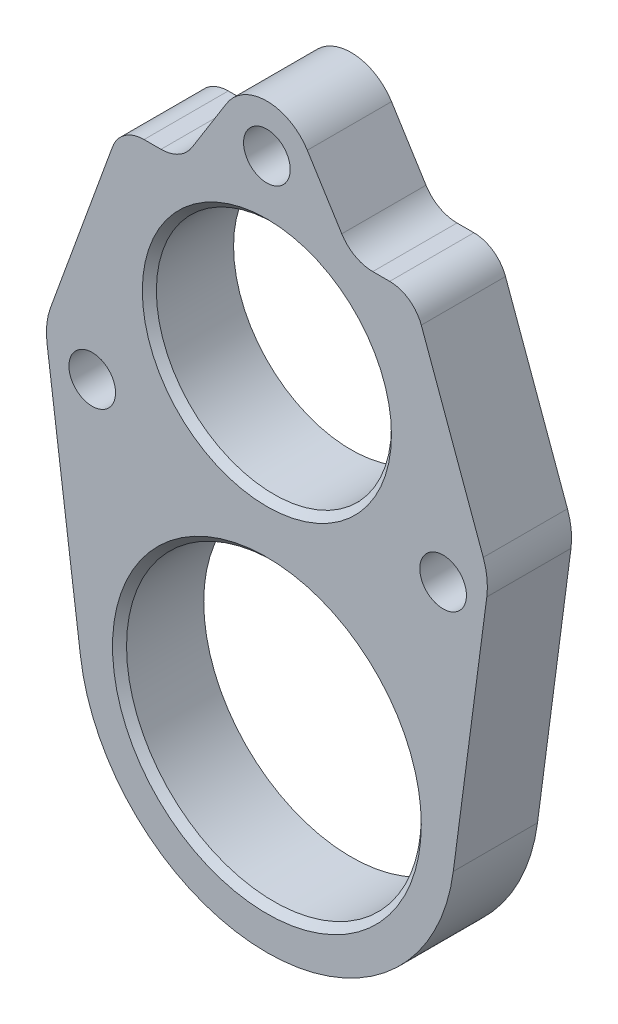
ISO-10303-21;
HEADER;
FILE_DESCRIPTION(('STEP AP214'),'2;1');
FILE_NAME('part.step','',(''),(''),'','','');
FILE_SCHEMA(('AUTOMOTIVE_DESIGN { 1 0 10303 214 1 1 1 1 }'));
ENDSEC;
DATA;
#1=APPLICATION_CONTEXT('core data for automotive mechanical design processes');
#2=APPLICATION_PROTOCOL_DEFINITION('international standard','automotive_design',2000,#1);
#3=PRODUCT_CONTEXT('',#1,'mechanical');
#4=PRODUCT('Part','Part','',(#3));
#5=PRODUCT_RELATED_PRODUCT_CATEGORY('part','',(#4));
#6=PRODUCT_DEFINITION_FORMATION('','',#4);
#7=PRODUCT_DEFINITION_CONTEXT('part definition',#1,'design');
#8=PRODUCT_DEFINITION('design','',#6,#7);
#9=PRODUCT_DEFINITION_SHAPE('','',#8);
#10=(LENGTH_UNIT() NAMED_UNIT(*) SI_UNIT(.MILLI.,.METRE.));
#11=(NAMED_UNIT(*) PLANE_ANGLE_UNIT() SI_UNIT($,.RADIAN.));
#12=(NAMED_UNIT(*) SI_UNIT($,.STERADIAN.) SOLID_ANGLE_UNIT());
#13=UNCERTAINTY_MEASURE_WITH_UNIT(LENGTH_MEASURE(1.E-05),#10,'distance_accuracy_value','');
#14=(GEOMETRIC_REPRESENTATION_CONTEXT(3) GLOBAL_UNCERTAINTY_ASSIGNED_CONTEXT((#13)) GLOBAL_UNIT_ASSIGNED_CONTEXT((#10,
#11,#12)) REPRESENTATION_CONTEXT('',''));
#15=CARTESIAN_POINT('',(0.,0.,0.));
#16=DIRECTION('',(0.,0.,1.));
#17=DIRECTION('',(1.,0.,0.));
#18=AXIS2_PLACEMENT_3D('',#15,#16,#17);
#19=CARTESIAN_POINT('',(-17.5,14.,12.));
#20=DIRECTION('',(0.,0.,-1.));
#21=DIRECTION('',(-1.,0.,0.));
#22=AXIS2_PLACEMENT_3D('',#19,#20,#21);
#23=CYLINDRICAL_SURFACE('',#22,4.79053922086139);
#24=CARTESIAN_POINT('',(-17.5,14.,0.));
#25=DIRECTION('',(0.,0.,1.));
#26=DIRECTION('',(1.,0.,0.));
#27=AXIS2_PLACEMENT_3D('',#24,#25,#26);
#28=CIRCLE('',#27,4.79053922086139);
#29=CARTESIAN_POINT('',(-17.5,18.7905392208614,0.));
#30=VERTEX_POINT('',#29);
#31=CARTESIAN_POINT('',(-22.0016343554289,15.6384609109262,0.));
#32=VERTEX_POINT('',#31);
#33=EDGE_CURVE('E149',#30,#32,#28,.T.);
#34=ORIENTED_EDGE('',*,*,#33,.T.);
#35=DIRECTION('',(0.,0.,-1.));
#36=VECTOR('',#35,1.);
#37=CARTESIAN_POINT('',(-22.0016343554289,15.6384609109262,12.));
#38=LINE('',#37,#36);
#39=CARTESIAN_POINT('',(-22.0016343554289,15.6384609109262,12.));
#40=VERTEX_POINT('',#39);
#41=EDGE_CURVE('E157',#40,#32,#38,.T.);
#42=ORIENTED_EDGE('',*,*,#41,.F.);
#43=CARTESIAN_POINT('',(-17.5,14.,12.));
#44=DIRECTION('',(0.,0.,1.));
#45=DIRECTION('',(1.,0.,0.));
#46=AXIS2_PLACEMENT_3D('',#43,#44,#45);
#47=CIRCLE('',#46,4.79053922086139);
#48=CARTESIAN_POINT('',(-17.5,18.7905392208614,12.));
#49=VERTEX_POINT('',#48);
#50=EDGE_CURVE('E201',#49,#40,#47,.T.);
#51=ORIENTED_EDGE('',*,*,#50,.F.);
#52=DIRECTION('',(0.,0.,-1.));
#53=VECTOR('',#52,1.);
#54=CARTESIAN_POINT('',(-17.5,18.7905392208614,12.));
#55=LINE('',#54,#53);
#56=EDGE_CURVE('E166',#49,#30,#55,.T.);
#57=ORIENTED_EDGE('',*,*,#56,.T.);
#58=EDGE_LOOP('',(#34,#42,#51,#57));
#59=FACE_BOUND('',#58,.T.);
#60=ADVANCED_FACE('F32',(#59),#23,.T.);
#61=CARTESIAN_POINT('',(-22.0016343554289,15.6384609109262,12.));
#62=DIRECTION('',(0.939692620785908,-0.342020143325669,0.));
#63=DIRECTION('',(0.34202014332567,0.939692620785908,0.));
#64=AXIS2_PLACEMENT_3D('',#61,#62,#63);
#65=PLANE('',#64);
#66=DIRECTION('',(-0.34202014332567,-0.939692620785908,0.));
#67=VECTOR('',#66,1.);
#68=CARTESIAN_POINT('',(-22.0016343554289,15.6384609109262,0.));
#69=LINE('',#68,#67);
#70=CARTESIAN_POINT('',(-30.8281438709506,-8.61217467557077,0.));
#71=VERTEX_POINT('',#70);
#72=EDGE_CURVE('E144',#32,#71,#69,.T.);
#73=ORIENTED_EDGE('',*,*,#72,.T.);
#74=DIRECTION('',(0.,0.,-1.));
#75=VECTOR('',#74,1.);
#76=CARTESIAN_POINT('',(-30.8281438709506,-8.61217467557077,12.));
#77=LINE('',#76,#75);
#78=CARTESIAN_POINT('',(-30.8281438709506,-8.61217467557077,12.));
#79=VERTEX_POINT('',#78);
#80=EDGE_CURVE('E163',#79,#71,#77,.T.);
#81=ORIENTED_EDGE('',*,*,#80,.F.);
#82=DIRECTION('',(-0.34202014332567,-0.939692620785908,0.));
#83=VECTOR('',#82,1.);
#84=CARTESIAN_POINT('',(-22.0016343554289,15.6384609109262,12.));
#85=LINE('',#84,#83);
#86=EDGE_CURVE('E159',#40,#79,#85,.T.);
#87=ORIENTED_EDGE('',*,*,#86,.F.);
#88=ORIENTED_EDGE('',*,*,#41,.T.);
#89=EDGE_LOOP('',(#73,#81,#87,#88));
#90=FACE_BOUND('',#89,.T.);
#91=ADVANCED_FACE('F158',(#90),#65,.F.);
#92=CARTESIAN_POINT('',(-21.6280464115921,-11.9607363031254,12.));
#93=DIRECTION('',(0.,0.,-1.));
#94=DIRECTION('',(-1.,0.,0.));
#95=AXIS2_PLACEMENT_3D('',#92,#93,#94);
#96=CYLINDRICAL_SURFACE('',#95,9.79053922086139);
#97=CARTESIAN_POINT('',(-21.6280464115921,-11.9607363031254,0.));
#98=DIRECTION('',(0.,0.,1.));
#99=DIRECTION('',(1.,0.,0.));
#100=AXIS2_PLACEMENT_3D('',#97,#98,#99);
#101=CIRCLE('',#100,9.79053922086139);
#102=CARTESIAN_POINT('',(-31.3348262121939,-13.2386581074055,0.));
#103=VERTEX_POINT('',#102);
#104=EDGE_CURVE('E151',#71,#103,#101,.T.);
#105=ORIENTED_EDGE('',*,*,#104,.T.);
#106=DIRECTION('',(0.,0.,-1.));
#107=VECTOR('',#106,1.);
#108=CARTESIAN_POINT('',(-31.3348262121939,-13.2386581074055,12.));
#109=LINE('',#108,#107);
#110=CARTESIAN_POINT('',(-31.3348262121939,-13.2386581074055,12.));
#111=VERTEX_POINT('',#110);
#112=EDGE_CURVE('E267',#111,#103,#109,.T.);
#113=ORIENTED_EDGE('',*,*,#112,.F.);
#114=CARTESIAN_POINT('',(-21.6280464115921,-11.9607363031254,12.));
#115=DIRECTION('',(0.,0.,1.));
#116=DIRECTION('',(1.,0.,0.));
#117=AXIS2_PLACEMENT_3D('',#114,#115,#116);
#118=CIRCLE('',#117,9.79053922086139);
#119=EDGE_CURVE('E204',#79,#111,#118,.T.);
#120=ORIENTED_EDGE('',*,*,#119,.F.);
#121=ORIENTED_EDGE('',*,*,#80,.T.);
#122=EDGE_LOOP('',(#105,#113,#120,#121));
#123=FACE_BOUND('',#122,.T.);
#124=ADVANCED_FACE('F307',(#123),#96,.T.);
#125=CARTESIAN_POINT('',(-31.3348262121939,-13.2386581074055,12.));
#126=DIRECTION('',(0.991444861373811,0.130526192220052,0.));
#127=DIRECTION('',(-0.130526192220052,0.991444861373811,0.));
#128=AXIS2_PLACEMENT_3D('',#125,#126,#127);
#129=PLANE('',#128);
#130=DIRECTION('',(0.130526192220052,-0.991444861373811,0.));
#131=VECTOR('',#130,1.);
#132=CARTESIAN_POINT('',(-31.3348262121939,-13.2386581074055,0.));
#133=LINE('',#132,#131);
#134=CARTESIAN_POINT('',(-26.5613424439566,-49.496867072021,0.));
#135=VERTEX_POINT('',#134);
#136=EDGE_CURVE('E175',#103,#135,#133,.T.);
#137=ORIENTED_EDGE('',*,*,#136,.T.);
#138=DIRECTION('',(0.,0.,-1.));
#139=VECTOR('',#138,1.);
#140=CARTESIAN_POINT('',(-26.5613424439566,-49.496867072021,12.));
#141=LINE('',#140,#139);
#142=CARTESIAN_POINT('',(-26.5613424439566,-49.496867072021,12.));
#143=VERTEX_POINT('',#142);
#144=EDGE_CURVE('E264',#143,#135,#141,.T.);
#145=ORIENTED_EDGE('',*,*,#144,.F.);
#146=DIRECTION('',(0.130526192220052,-0.991444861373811,0.));
#147=VECTOR('',#146,1.);
#148=CARTESIAN_POINT('',(-31.3348262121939,-13.2386581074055,12.));
#149=LINE('',#148,#147);
#150=EDGE_CURVE('E206',#111,#143,#149,.T.);
#151=ORIENTED_EDGE('',*,*,#150,.F.);
#152=ORIENTED_EDGE('',*,*,#112,.T.);
#153=EDGE_LOOP('',(#137,#145,#151,#152));
#154=FACE_BOUND('',#153,.T.);
#155=ADVANCED_FACE('F311',(#154),#129,.F.);
#156=CARTESIAN_POINT('',(0.,-46.,12.));
#157=DIRECTION('',(0.,0.,-1.));
#158=DIRECTION('',(-1.,0.,0.));
#159=AXIS2_PLACEMENT_3D('',#156,#157,#158);
#160=CYLINDRICAL_SURFACE('',#159,26.7905392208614);
#161=CARTESIAN_POINT('',(0.,-46.,0.));
#162=DIRECTION('',(0.,0.,1.));
#163=DIRECTION('',(1.,0.,0.));
#164=AXIS2_PLACEMENT_3D('',#161,#162,#163);
#165=CIRCLE('',#164,26.7905392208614);
#166=CARTESIAN_POINT('',(26.5613424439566,-49.496867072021,0.));
#167=VERTEX_POINT('',#166);
#168=EDGE_CURVE('E177',#135,#167,#165,.T.);
#169=ORIENTED_EDGE('',*,*,#168,.T.);
#170=DIRECTION('',(0.,0.,-1.));
#171=VECTOR('',#170,1.);
#172=CARTESIAN_POINT('',(26.5613424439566,-49.496867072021,12.));
#173=LINE('',#172,#171);
#174=CARTESIAN_POINT('',(26.5613424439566,-49.496867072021,12.));
#175=VERTEX_POINT('',#174);
#176=EDGE_CURVE('E261',#175,#167,#173,.T.);
#177=ORIENTED_EDGE('',*,*,#176,.F.);
#178=CARTESIAN_POINT('',(0.,-46.,12.));
#179=DIRECTION('',(0.,0.,1.));
#180=DIRECTION('',(1.,0.,0.));
#181=AXIS2_PLACEMENT_3D('',#178,#179,#180);
#182=CIRCLE('',#181,26.7905392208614);
#183=EDGE_CURVE('E208',#143,#175,#182,.T.);
#184=ORIENTED_EDGE('',*,*,#183,.F.);
#185=ORIENTED_EDGE('',*,*,#144,.T.);
#186=EDGE_LOOP('',(#169,#177,#184,#185));
#187=FACE_BOUND('',#186,.T.);
#188=ADVANCED_FACE('F317',(#187),#160,.T.);
#189=CARTESIAN_POINT('',(26.5613424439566,-49.496867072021,12.));
#190=DIRECTION('',(-0.991444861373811,0.130526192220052,0.));
#191=DIRECTION('',(-0.130526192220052,-0.991444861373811,0.));
#192=AXIS2_PLACEMENT_3D('',#189,#190,#191);
#193=PLANE('',#192);
#194=DIRECTION('',(0.130526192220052,0.991444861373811,0.));
#195=VECTOR('',#194,1.);
#196=CARTESIAN_POINT('',(26.5613424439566,-49.496867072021,0.));
#197=LINE('',#196,#195);
#198=CARTESIAN_POINT('',(31.3348262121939,-13.2386581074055,0.));
#199=VERTEX_POINT('',#198);
#200=EDGE_CURVE('E179',#167,#199,#197,.T.);
#201=ORIENTED_EDGE('',*,*,#200,.T.);
#202=DIRECTION('',(0.,0.,-1.));
#203=VECTOR('',#202,1.);
#204=CARTESIAN_POINT('',(31.3348262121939,-13.2386581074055,12.));
#205=LINE('',#204,#203);
#206=CARTESIAN_POINT('',(31.3348262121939,-13.2386581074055,12.));
#207=VERTEX_POINT('',#206);
#208=EDGE_CURVE('E258',#207,#199,#205,.T.);
#209=ORIENTED_EDGE('',*,*,#208,.F.);
#210=DIRECTION('',(0.130526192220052,0.991444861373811,0.));
#211=VECTOR('',#210,1.);
#212=CARTESIAN_POINT('',(26.5613424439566,-49.496867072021,12.));
#213=LINE('',#212,#211);
#214=EDGE_CURVE('E210',#175,#207,#213,.T.);
#215=ORIENTED_EDGE('',*,*,#214,.F.);
#216=ORIENTED_EDGE('',*,*,#176,.T.);
#217=EDGE_LOOP('',(#201,#209,#215,#216));
#218=FACE_BOUND('',#217,.T.);
#219=ADVANCED_FACE('F321',(#218),#193,.F.);
#220=CARTESIAN_POINT('',(21.6280464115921,-11.9607363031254,12.));
#221=DIRECTION('',(0.,0.,-1.));
#222=DIRECTION('',(-1.,0.,0.));
#223=AXIS2_PLACEMENT_3D('',#220,#221,#222);
#224=CYLINDRICAL_SURFACE('',#223,9.79053922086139);
#225=CARTESIAN_POINT('',(21.6280464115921,-11.9607363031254,0.));
#226=DIRECTION('',(0.,0.,1.));
#227=DIRECTION('',(1.,0.,0.));
#228=AXIS2_PLACEMENT_3D('',#225,#226,#227);
#229=CIRCLE('',#228,9.79053922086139);
#230=CARTESIAN_POINT('',(30.8281438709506,-8.61217467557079,0.));
#231=VERTEX_POINT('',#230);
#232=EDGE_CURVE('E181',#199,#231,#229,.T.);
#233=ORIENTED_EDGE('',*,*,#232,.T.);
#234=DIRECTION('',(0.,0.,-1.));
#235=VECTOR('',#234,1.);
#236=CARTESIAN_POINT('',(30.8281438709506,-8.61217467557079,12.));
#237=LINE('',#236,#235);
#238=CARTESIAN_POINT('',(30.8281438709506,-8.61217467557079,12.));
#239=VERTEX_POINT('',#238);
#240=EDGE_CURVE('E255',#239,#231,#237,.T.);
#241=ORIENTED_EDGE('',*,*,#240,.F.);
#242=CARTESIAN_POINT('',(21.6280464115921,-11.9607363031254,12.));
#243=DIRECTION('',(0.,0.,1.));
#244=DIRECTION('',(1.,0.,0.));
#245=AXIS2_PLACEMENT_3D('',#242,#243,#244);
#246=CIRCLE('',#245,9.79053922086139);
#247=EDGE_CURVE('E212',#207,#239,#246,.T.);
#248=ORIENTED_EDGE('',*,*,#247,.F.);
#249=ORIENTED_EDGE('',*,*,#208,.T.);
#250=EDGE_LOOP('',(#233,#241,#248,#249));
#251=FACE_BOUND('',#250,.T.);
#252=ADVANCED_FACE('F326',(#251),#224,.T.);
#253=CARTESIAN_POINT('',(30.8281438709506,-8.61217467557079,12.));
#254=DIRECTION('',(-0.939692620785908,-0.34202014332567,0.));
#255=DIRECTION('',(0.342020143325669,-0.939692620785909,0.));
#256=AXIS2_PLACEMENT_3D('',#253,#254,#255);
#257=PLANE('',#256);
#258=DIRECTION('',(-0.342020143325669,0.939692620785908,0.));
#259=VECTOR('',#258,1.);
#260=CARTESIAN_POINT('',(30.8281438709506,-8.61217467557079,0.));
#261=LINE('',#260,#259);
#262=CARTESIAN_POINT('',(22.0016343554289,15.6384609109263,0.));
#263=VERTEX_POINT('',#262);
#264=EDGE_CURVE('E183',#231,#263,#261,.T.);
#265=ORIENTED_EDGE('',*,*,#264,.T.);
#266=DIRECTION('',(0.,0.,-1.));
#267=VECTOR('',#266,1.);
#268=CARTESIAN_POINT('',(22.0016343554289,15.6384609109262,12.));
#269=LINE('',#268,#267);
#270=CARTESIAN_POINT('',(22.0016343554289,15.6384609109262,12.));
#271=VERTEX_POINT('',#270);
#272=EDGE_CURVE('E252',#271,#263,#269,.T.);
#273=ORIENTED_EDGE('',*,*,#272,.F.);
#274=DIRECTION('',(-0.342020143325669,0.939692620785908,0.));
#275=VECTOR('',#274,1.);
#276=CARTESIAN_POINT('',(30.8281438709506,-8.61217467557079,12.));
#277=LINE('',#276,#275);
#278=EDGE_CURVE('E214',#239,#271,#277,.T.);
#279=ORIENTED_EDGE('',*,*,#278,.F.);
#280=ORIENTED_EDGE('',*,*,#240,.T.);
#281=EDGE_LOOP('',(#265,#273,#279,#280));
#282=FACE_BOUND('',#281,.T.);
#283=ADVANCED_FACE('F332',(#282),#257,.F.);
#284=CARTESIAN_POINT('',(17.5,14.,12.));
#285=DIRECTION('',(0.,0.,-1.));
#286=DIRECTION('',(-1.,0.,0.));
#287=AXIS2_PLACEMENT_3D('',#284,#285,#286);
#288=CYLINDRICAL_SURFACE('',#287,4.79053922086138);
#289=CARTESIAN_POINT('',(17.5,14.,0.));
#290=DIRECTION('',(0.,0.,1.));
#291=DIRECTION('',(1.,0.,0.));
#292=AXIS2_PLACEMENT_3D('',#289,#290,#291);
#293=CIRCLE('',#292,4.79053922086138);
#294=CARTESIAN_POINT('',(17.5,18.7905392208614,0.));
#295=VERTEX_POINT('',#294);
#296=EDGE_CURVE('E185',#263,#295,#293,.T.);
#297=ORIENTED_EDGE('',*,*,#296,.T.);
#298=DIRECTION('',(0.,0.,-1.));
#299=VECTOR('',#298,1.);
#300=CARTESIAN_POINT('',(17.5,18.7905392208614,12.));
#301=LINE('',#300,#299);
#302=CARTESIAN_POINT('',(17.5,18.7905392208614,12.));
#303=VERTEX_POINT('',#302);
#304=EDGE_CURVE('E249',#303,#295,#301,.T.);
#305=ORIENTED_EDGE('',*,*,#304,.F.);
#306=CARTESIAN_POINT('',(17.5,14.,12.));
#307=DIRECTION('',(0.,0.,1.));
#308=DIRECTION('',(1.,0.,0.));
#309=AXIS2_PLACEMENT_3D('',#306,#307,#308);
#310=CIRCLE('',#309,4.79053922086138);
#311=EDGE_CURVE('E216',#271,#303,#310,.T.);
#312=ORIENTED_EDGE('',*,*,#311,.F.);
#313=ORIENTED_EDGE('',*,*,#272,.T.);
#314=EDGE_LOOP('',(#297,#305,#312,#313));
#315=FACE_BOUND('',#314,.T.);
#316=ADVANCED_FACE('F336',(#315),#288,.T.);
#317=CARTESIAN_POINT('',(17.5,18.7905392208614,12.));
#318=DIRECTION('',(0.,-1.,0.));
#319=DIRECTION('',(0.,0.,-1.));
#320=AXIS2_PLACEMENT_3D('',#317,#318,#319);
#321=PLANE('',#320);
#322=DIRECTION('',(-1.,0.,0.));
#323=VECTOR('',#322,1.);
#324=CARTESIAN_POINT('',(17.5,18.7905392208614,0.));
#325=LINE('',#324,#323);
#326=CARTESIAN_POINT('',(15.0874448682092,18.7905392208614,0.));
#327=VERTEX_POINT('',#326);
#328=EDGE_CURVE('E187',#295,#327,#325,.T.);
#329=ORIENTED_EDGE('',*,*,#328,.T.);
#330=DIRECTION('',(0.,0.,-1.));
#331=VECTOR('',#330,1.);
#332=CARTESIAN_POINT('',(15.0874448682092,18.7905392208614,12.));
#333=LINE('',#332,#331);
#334=CARTESIAN_POINT('',(15.0874448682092,18.7905392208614,12.));
#335=VERTEX_POINT('',#334);
#336=EDGE_CURVE('E246',#335,#327,#333,.T.);
#337=ORIENTED_EDGE('',*,*,#336,.F.);
#338=DIRECTION('',(-1.,0.,0.));
#339=VECTOR('',#338,1.);
#340=CARTESIAN_POINT('',(17.5,18.7905392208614,12.));
#341=LINE('',#340,#339);
#342=EDGE_CURVE('E218',#303,#335,#341,.T.);
#343=ORIENTED_EDGE('',*,*,#342,.F.);
#344=ORIENTED_EDGE('',*,*,#304,.T.);
#345=EDGE_LOOP('',(#329,#337,#343,#344));
#346=FACE_BOUND('',#345,.T.);
#347=ADVANCED_FACE('F341',(#346),#321,.F.);
#348=CARTESIAN_POINT('',(15.0874448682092,24.,12.));
#349=DIRECTION('',(0.,0.,-1.));
#350=DIRECTION('',(-1.,0.,0.));
#351=AXIS2_PLACEMENT_3D('',#348,#349,#350);
#352=CYLINDRICAL_SURFACE('',#351,5.20946077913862);
#353=CARTESIAN_POINT('',(15.0874448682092,24.,0.));
#354=DIRECTION('',(0.,0.,-1.));
#355=DIRECTION('',(1.,0.,0.));
#356=AXIS2_PLACEMENT_3D('',#353,#354,#355);
#357=CIRCLE('',#356,5.20946077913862);
#358=CARTESIAN_POINT('',(10.6695715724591,21.2394063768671,0.));
#359=VERTEX_POINT('',#358);
#360=EDGE_CURVE('E189',#327,#359,#357,.T.);
#361=ORIENTED_EDGE('',*,*,#360,.T.);
#362=DIRECTION('',(0.,0.,-1.));
#363=VECTOR('',#362,1.);
#364=CARTESIAN_POINT('',(10.6695715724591,21.2394063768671,12.));
#365=LINE('',#364,#363);
#366=CARTESIAN_POINT('',(10.6695715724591,21.2394063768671,12.));
#367=VERTEX_POINT('',#366);
#368=EDGE_CURVE('E243',#367,#359,#365,.T.);
#369=ORIENTED_EDGE('',*,*,#368,.F.);
#370=CARTESIAN_POINT('',(15.0874448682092,24.,12.));
#371=DIRECTION('',(0.,0.,-1.));
#372=DIRECTION('',(1.,0.,0.));
#373=AXIS2_PLACEMENT_3D('',#370,#371,#372);
#374=CIRCLE('',#373,5.20946077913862);
#375=EDGE_CURVE('E220',#335,#367,#374,.T.);
#376=ORIENTED_EDGE('',*,*,#375,.F.);
#377=ORIENTED_EDGE('',*,*,#336,.T.);
#378=EDGE_LOOP('',(#361,#369,#376,#377));
#379=FACE_BOUND('',#378,.T.);
#380=ADVANCED_FACE('F347',(#379),#352,.F.);
#381=CARTESIAN_POINT('',(10.6695715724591,21.2394063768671,12.));
#382=DIRECTION('',(-0.848048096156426,-0.529919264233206,0.));
#383=DIRECTION('',(0.529919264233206,-0.848048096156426,0.));
#384=AXIS2_PLACEMENT_3D('',#381,#382,#383);
#385=PLANE('',#384);
#386=DIRECTION('',(-0.529919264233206,0.848048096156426,0.));
#387=VECTOR('',#386,1.);
#388=CARTESIAN_POINT('',(10.6695715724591,21.2394063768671,0.));
#389=LINE('',#388,#387);
#390=CARTESIAN_POINT('',(5.75870385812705,29.0984375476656,0.));
#391=VERTEX_POINT('',#390);
#392=EDGE_CURVE('E191',#359,#391,#389,.T.);
#393=ORIENTED_EDGE('',*,*,#392,.T.);
#394=DIRECTION('',(0.,0.,-1.));
#395=VECTOR('',#394,1.);
#396=CARTESIAN_POINT('',(5.75870385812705,29.0984375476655,12.));
#397=LINE('',#396,#395);
#398=CARTESIAN_POINT('',(5.75870385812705,29.0984375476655,12.));
#399=VERTEX_POINT('',#398);
#400=EDGE_CURVE('E240',#399,#391,#397,.T.);
#401=ORIENTED_EDGE('',*,*,#400,.F.);
#402=DIRECTION('',(-0.529919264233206,0.848048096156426,0.));
#403=VECTOR('',#402,1.);
#404=CARTESIAN_POINT('',(10.6695715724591,21.2394063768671,12.));
#405=LINE('',#404,#403);
#406=EDGE_CURVE('E222',#367,#399,#405,.T.);
#407=ORIENTED_EDGE('',*,*,#406,.F.);
#408=ORIENTED_EDGE('',*,*,#368,.T.);
#409=EDGE_LOOP('',(#393,#401,#407,#408));
#410=FACE_BOUND('',#409,.T.);
#411=ADVANCED_FACE('F351',(#410),#385,.F.);
#412=CARTESIAN_POINT('',(0.,25.4999999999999,12.));
#413=DIRECTION('',(0.,0.,-1.));
#414=DIRECTION('',(-1.,0.,0.));
#415=AXIS2_PLACEMENT_3D('',#412,#413,#414);
#416=CYLINDRICAL_SURFACE('',#415,6.79053922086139);
#417=CARTESIAN_POINT('',(0.,25.5,0.));
#418=DIRECTION('',(0.,0.,1.));
#419=DIRECTION('',(1.,0.,0.));
#420=AXIS2_PLACEMENT_3D('',#417,#418,#419);
#421=CIRCLE('',#420,6.79053922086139);
#422=CARTESIAN_POINT('',(-5.75870385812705,29.0984375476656,0.));
#423=VERTEX_POINT('',#422);
#424=EDGE_CURVE('E193',#391,#423,#421,.T.);
#425=ORIENTED_EDGE('',*,*,#424,.T.);
#426=DIRECTION('',(0.,0.,-1.));
#427=VECTOR('',#426,1.);
#428=CARTESIAN_POINT('',(-5.75870385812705,29.0984375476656,12.));
#429=LINE('',#428,#427);
#430=CARTESIAN_POINT('',(-5.75870385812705,29.0984375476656,12.));
#431=VERTEX_POINT('',#430);
#432=EDGE_CURVE('E237',#431,#423,#429,.T.);
#433=ORIENTED_EDGE('',*,*,#432,.F.);
#434=CARTESIAN_POINT('',(0.,25.4999999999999,12.));
#435=DIRECTION('',(0.,0.,1.));
#436=DIRECTION('',(1.,0.,0.));
#437=AXIS2_PLACEMENT_3D('',#434,#435,#436);
#438=CIRCLE('',#437,6.79053922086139);
#439=EDGE_CURVE('E224',#399,#431,#438,.T.);
#440=ORIENTED_EDGE('',*,*,#439,.F.);
#441=ORIENTED_EDGE('',*,*,#400,.T.);
#442=EDGE_LOOP('',(#425,#433,#440,#441));
#443=FACE_BOUND('',#442,.T.);
#444=ADVANCED_FACE('F356',(#443),#416,.T.);
#445=CARTESIAN_POINT('',(-5.75870385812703,29.0984375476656,12.));
#446=DIRECTION('',(0.848048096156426,-0.529919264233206,0.));
#447=DIRECTION('',(0.529919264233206,0.848048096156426,0.));
#448=AXIS2_PLACEMENT_3D('',#445,#446,#447);
#449=PLANE('',#448);
#450=DIRECTION('',(-0.529919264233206,-0.848048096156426,0.));
#451=VECTOR('',#450,1.);
#452=CARTESIAN_POINT('',(-5.75870385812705,29.0984375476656,0.));
#453=LINE('',#452,#451);
#454=CARTESIAN_POINT('',(-10.6695715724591,21.2394063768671,0.));
#455=VERTEX_POINT('',#454);
#456=EDGE_CURVE('E195',#423,#455,#453,.T.);
#457=ORIENTED_EDGE('',*,*,#456,.T.);
#458=DIRECTION('',(0.,0.,-1.));
#459=VECTOR('',#458,1.);
#460=CARTESIAN_POINT('',(-10.6695715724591,21.2394063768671,12.));
#461=LINE('',#460,#459);
#462=CARTESIAN_POINT('',(-10.6695715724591,21.2394063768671,12.));
#463=VERTEX_POINT('',#462);
#464=EDGE_CURVE('E234',#463,#455,#461,.T.);
#465=ORIENTED_EDGE('',*,*,#464,.F.);
#466=DIRECTION('',(-0.529919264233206,-0.848048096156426,0.));
#467=VECTOR('',#466,1.);
#468=CARTESIAN_POINT('',(-5.75870385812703,29.0984375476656,12.));
#469=LINE('',#468,#467);
#470=EDGE_CURVE('E226',#431,#463,#469,.T.);
#471=ORIENTED_EDGE('',*,*,#470,.F.);
#472=ORIENTED_EDGE('',*,*,#432,.T.);
#473=EDGE_LOOP('',(#457,#465,#471,#472));
#474=FACE_BOUND('',#473,.T.);
#475=ADVANCED_FACE('F360',(#474),#449,.F.);
#476=CARTESIAN_POINT('',(-15.0874448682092,24.,12.));
#477=DIRECTION('',(0.,0.,-1.));
#478=DIRECTION('',(-1.,0.,0.));
#479=AXIS2_PLACEMENT_3D('',#476,#477,#478);
#480=CYLINDRICAL_SURFACE('',#479,5.20946077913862);
#481=CARTESIAN_POINT('',(-15.0874448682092,24.,0.));
#482=DIRECTION('',(0.,0.,-1.));
#483=DIRECTION('',(1.,0.,0.));
#484=AXIS2_PLACEMENT_3D('',#481,#482,#483);
#485=CIRCLE('',#484,5.20946077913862);
#486=CARTESIAN_POINT('',(-15.0874448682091,18.7905392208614,0.));
#487=VERTEX_POINT('',#486);
#488=EDGE_CURVE('E197',#455,#487,#485,.T.);
#489=ORIENTED_EDGE('',*,*,#488,.T.);
#490=DIRECTION('',(0.,0.,-1.));
#491=VECTOR('',#490,1.);
#492=CARTESIAN_POINT('',(-15.0874448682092,18.7905392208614,12.));
#493=LINE('',#492,#491);
#494=CARTESIAN_POINT('',(-15.0874448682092,18.7905392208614,12.));
#495=VERTEX_POINT('',#494);
#496=EDGE_CURVE('E231',#495,#487,#493,.T.);
#497=ORIENTED_EDGE('',*,*,#496,.F.);
#498=CARTESIAN_POINT('',(-15.0874448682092,24.,12.));
#499=DIRECTION('',(0.,0.,-1.));
#500=DIRECTION('',(1.,0.,0.));
#501=AXIS2_PLACEMENT_3D('',#498,#499,#500);
#502=CIRCLE('',#501,5.20946077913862);
#503=EDGE_CURVE('E51',#463,#495,#502,.T.);
#504=ORIENTED_EDGE('',*,*,#503,.F.);
#505=ORIENTED_EDGE('',*,*,#464,.T.);
#506=EDGE_LOOP('',(#489,#497,#504,#505));
#507=FACE_BOUND('',#506,.T.);
#508=ADVANCED_FACE('F364',(#507),#480,.F.);
#509=CARTESIAN_POINT('',(-15.0874448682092,18.7905392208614,12.));
#510=DIRECTION('',(0.,-1.,0.));
#511=DIRECTION('',(1.,0.,0.));
#512=AXIS2_PLACEMENT_3D('',#509,#510,#511);
#513=PLANE('',#512);
#514=DIRECTION('',(-1.,0.,0.));
#515=VECTOR('',#514,1.);
#516=CARTESIAN_POINT('',(-15.0874448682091,18.7905392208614,0.));
#517=LINE('',#516,#515);
#518=EDGE_CURVE('E199',#487,#30,#517,.T.);
#519=ORIENTED_EDGE('',*,*,#518,.T.);
#520=ORIENTED_EDGE('',*,*,#56,.F.);
#521=DIRECTION('',(-1.,0.,0.));
#522=VECTOR('',#521,1.);
#523=CARTESIAN_POINT('',(-15.0874448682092,18.7905392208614,12.));
#524=LINE('',#523,#522);
#525=EDGE_CURVE('E46',#495,#49,#524,.T.);
#526=ORIENTED_EDGE('',*,*,#525,.F.);
#527=ORIENTED_EDGE('',*,*,#496,.T.);
#528=EDGE_LOOP('',(#519,#520,#526,#527));
#529=FACE_BOUND('',#528,.T.);
#530=ADVANCED_FACE('F291',(#529),#513,.F.);
#531=CARTESIAN_POINT('',(-17.5,14.,12.));
#532=DIRECTION('',(0.,0.,1.));
#533=DIRECTION('',(1.,0.,0.));
#534=AXIS2_PLACEMENT_3D('',#531,#532,#533);
#535=PLANE('',#534);
#536=CARTESIAN_POINT('',(0.,-46.,12.));
#537=DIRECTION('',(0.,0.,1.));
#538=DIRECTION('',(1.,0.,0.));
#539=AXIS2_PLACEMENT_3D('',#536,#537,#538);
#540=CIRCLE('',#539,22.);
#541=CARTESIAN_POINT('',(22.,-46.,12.));
#542=VERTEX_POINT('',#541);
#543=EDGE_CURVE('E273',#542,#542,#540,.F.);
#544=ORIENTED_EDGE('',*,*,#543,.T.);
#545=EDGE_LOOP('',(#544));
#546=FACE_BOUND('',#545,.T.);
#547=CARTESIAN_POINT('',(0.,0.,12.));
#548=DIRECTION('',(0.,0.,1.));
#549=DIRECTION('',(1.,0.,0.));
#550=AXIS2_PLACEMENT_3D('',#547,#548,#549);
#551=CIRCLE('',#550,17.75);
#552=CARTESIAN_POINT('',(17.75,0.,12.));
#553=VERTEX_POINT('',#552);
#554=EDGE_CURVE('E162',#553,#553,#551,.F.);
#555=ORIENTED_EDGE('',*,*,#554,.T.);
#556=EDGE_LOOP('',(#555));
#557=FACE_BOUND('',#556,.T.);
#558=CARTESIAN_POINT('',(-24.88840696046,-14.5,12.));
#559=DIRECTION('',(0.,0.,-1.));
#560=DIRECTION('',(-1.,0.,0.));
#561=AXIS2_PLACEMENT_3D('',#558,#559,#560);
#562=CIRCLE('',#561,3.3235);
#563=CARTESIAN_POINT('',(-28.21190696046,-14.5,12.));
#564=VERTEX_POINT('',#563);
#565=EDGE_CURVE('E298',#564,#564,#562,.T.);
#566=ORIENTED_EDGE('',*,*,#565,.T.);
#567=EDGE_LOOP('',(#566));
#568=FACE_BOUND('',#567,.T.);
#569=CARTESIAN_POINT('',(25.11159303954,-14.5,12.));
#570=DIRECTION('',(0.,0.,-1.));
#571=DIRECTION('',(-1.,0.,0.));
#572=AXIS2_PLACEMENT_3D('',#569,#570,#571);
#573=CIRCLE('',#572,3.3235);
#574=CARTESIAN_POINT('',(21.78809303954,-14.5,12.));
#575=VERTEX_POINT('',#574);
#576=EDGE_CURVE('E302',#575,#575,#573,.T.);
#577=ORIENTED_EDGE('',*,*,#576,.T.);
#578=EDGE_LOOP('',(#577));
#579=FACE_BOUND('',#578,.T.);
#580=CARTESIAN_POINT('',(0.,25.4999999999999,12.));
#581=DIRECTION('',(0.,0.,-1.));
#582=DIRECTION('',(-1.,0.,0.));
#583=AXIS2_PLACEMENT_3D('',#580,#581,#582);
#584=CIRCLE('',#583,3.3235);
#585=CARTESIAN_POINT('',(-3.32349999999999,25.4999999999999,12.));
#586=VERTEX_POINT('',#585);
#587=EDGE_CURVE('E167',#586,#586,#584,.T.);
#588=ORIENTED_EDGE('',*,*,#587,.T.);
#589=EDGE_LOOP('',(#588));
#590=FACE_BOUND('',#589,.T.);
#591=ORIENTED_EDGE('',*,*,#50,.T.);
#592=ORIENTED_EDGE('',*,*,#86,.T.);
#593=ORIENTED_EDGE('',*,*,#119,.T.);
#594=ORIENTED_EDGE('',*,*,#150,.T.);
#595=ORIENTED_EDGE('',*,*,#183,.T.);
#596=ORIENTED_EDGE('',*,*,#214,.T.);
#597=ORIENTED_EDGE('',*,*,#247,.T.);
#598=ORIENTED_EDGE('',*,*,#278,.T.);
#599=ORIENTED_EDGE('',*,*,#311,.T.);
#600=ORIENTED_EDGE('',*,*,#342,.T.);
#601=ORIENTED_EDGE('',*,*,#375,.T.);
#602=ORIENTED_EDGE('',*,*,#406,.T.);
#603=ORIENTED_EDGE('',*,*,#439,.T.);
#604=ORIENTED_EDGE('',*,*,#470,.T.);
#605=ORIENTED_EDGE('',*,*,#503,.T.);
#606=ORIENTED_EDGE('',*,*,#525,.T.);
#607=EDGE_LOOP('',(#591,#592,#593,#594,#595,#596,#597,#598,#599,#600,#601,#602,#603,#604,#605,#606));
#608=FACE_BOUND('',#607,.T.);
#609=ADVANCED_FACE('F288',(#546,#557,#568,#579,#590,#608),#535,.T.);
#610=CARTESIAN_POINT('',(-17.5,14.,0.));
#611=DIRECTION('',(0.,0.,1.));
#612=DIRECTION('',(1.,0.,0.));
#613=AXIS2_PLACEMENT_3D('',#610,#611,#612);
#614=PLANE('',#613);
#615=CARTESIAN_POINT('',(0.,-46.,0.));
#616=DIRECTION('',(0.,0.,-1.));
#617=DIRECTION('',(-1.,0.,0.));
#618=AXIS2_PLACEMENT_3D('',#615,#616,#617);
#619=CIRCLE('',#618,21.);
#620=CARTESIAN_POINT('',(-21.,-46.,0.));
#621=VERTEX_POINT('',#620);
#622=EDGE_CURVE('E505',#621,#621,#619,.T.);
#623=ORIENTED_EDGE('',*,*,#622,.F.);
#624=EDGE_LOOP('',(#623));
#625=FACE_BOUND('',#624,.T.);
#626=CARTESIAN_POINT('',(0.,0.,0.));
#627=DIRECTION('',(0.,0.,-1.));
#628=DIRECTION('',(-1.,0.,0.));
#629=AXIS2_PLACEMENT_3D('',#626,#627,#628);
#630=CIRCLE('',#629,16.75);
#631=CARTESIAN_POINT('',(-16.75,0.,0.));
#632=VERTEX_POINT('',#631);
#633=EDGE_CURVE('E502',#632,#632,#630,.T.);
#634=ORIENTED_EDGE('',*,*,#633,.F.);
#635=EDGE_LOOP('',(#634));
#636=FACE_BOUND('',#635,.T.);
#637=CARTESIAN_POINT('',(-24.88840696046,-14.5,0.));
#638=DIRECTION('',(0.,0.,-1.));
#639=DIRECTION('',(-1.,0.,0.));
#640=AXIS2_PLACEMENT_3D('',#637,#638,#639);
#641=CIRCLE('',#640,3.3235);
#642=CARTESIAN_POINT('',(-28.21190696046,-14.5,0.));
#643=VERTEX_POINT('',#642);
#644=EDGE_CURVE('E504',#643,#643,#641,.T.);
#645=ORIENTED_EDGE('',*,*,#644,.F.);
#646=EDGE_LOOP('',(#645));
#647=FACE_BOUND('',#646,.T.);
#648=CARTESIAN_POINT('',(25.11159303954,-14.5,0.));
#649=DIRECTION('',(0.,0.,-1.));
#650=DIRECTION('',(-1.,0.,0.));
#651=AXIS2_PLACEMENT_3D('',#648,#649,#650);
#652=CIRCLE('',#651,3.3235);
#653=CARTESIAN_POINT('',(21.78809303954,-14.5,0.));
#654=VERTEX_POINT('',#653);
#655=EDGE_CURVE('E513',#654,#654,#652,.T.);
#656=ORIENTED_EDGE('',*,*,#655,.F.);
#657=EDGE_LOOP('',(#656));
#658=FACE_BOUND('',#657,.T.);
#659=CARTESIAN_POINT('',(0.,25.5,0.));
#660=DIRECTION('',(0.,0.,-1.));
#661=DIRECTION('',(-1.,0.,0.));
#662=AXIS2_PLACEMENT_3D('',#659,#660,#661);
#663=CIRCLE('',#662,3.3235);
#664=CARTESIAN_POINT('',(-3.32349999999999,25.4999999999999,0.));
#665=VERTEX_POINT('',#664);
#666=EDGE_CURVE('E170',#665,#665,#663,.T.);
#667=ORIENTED_EDGE('',*,*,#666,.F.);
#668=EDGE_LOOP('',(#667));
#669=FACE_BOUND('',#668,.T.);
#670=ORIENTED_EDGE('',*,*,#33,.F.);
#671=ORIENTED_EDGE('',*,*,#518,.F.);
#672=ORIENTED_EDGE('',*,*,#488,.F.);
#673=ORIENTED_EDGE('',*,*,#456,.F.);
#674=ORIENTED_EDGE('',*,*,#424,.F.);
#675=ORIENTED_EDGE('',*,*,#392,.F.);
#676=ORIENTED_EDGE('',*,*,#360,.F.);
#677=ORIENTED_EDGE('',*,*,#328,.F.);
#678=ORIENTED_EDGE('',*,*,#296,.F.);
#679=ORIENTED_EDGE('',*,*,#264,.F.);
#680=ORIENTED_EDGE('',*,*,#232,.F.);
#681=ORIENTED_EDGE('',*,*,#200,.F.);
#682=ORIENTED_EDGE('',*,*,#168,.F.);
#683=ORIENTED_EDGE('',*,*,#136,.F.);
#684=ORIENTED_EDGE('',*,*,#104,.F.);
#685=ORIENTED_EDGE('',*,*,#72,.F.);
#686=EDGE_LOOP('',(#670,#671,#672,#673,#674,#675,#676,#677,#678,#679,#680,#681,#682,#683,#684,#685));
#687=FACE_BOUND('',#686,.T.);
#688=ADVANCED_FACE('F146',(#625,#636,#647,#658,#669,#687),#614,.F.);
#689=CARTESIAN_POINT('',(0.,25.4999999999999,12.));
#690=DIRECTION('',(0.,0.,-1.));
#691=DIRECTION('',(-1.,0.,0.));
#692=AXIS2_PLACEMENT_3D('',#689,#690,#691);
#693=CYLINDRICAL_SURFACE('',#692,3.3235);
#694=CARTESIAN_POINT('',(-3.32349999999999,25.4999999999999,12.));
#695=CARTESIAN_POINT('',(-3.32349999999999,25.4999999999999,11.875));
#696=CARTESIAN_POINT('',(-3.32349999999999,25.4999999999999,11.75));
#697=CARTESIAN_POINT('',(-3.32349999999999,25.4999999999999,11.5));
#698=CARTESIAN_POINT('',(-3.32349999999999,25.4999999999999,11.375));
#699=CARTESIAN_POINT('',(-3.32349999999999,25.4999999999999,11.125));
#700=CARTESIAN_POINT('',(-3.32349999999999,25.4999999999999,11.));
#701=CARTESIAN_POINT('',(-3.32349999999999,25.4999999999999,10.75));
#702=CARTESIAN_POINT('',(-3.32349999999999,25.4999999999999,10.625));
#703=CARTESIAN_POINT('',(-3.32349999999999,25.4999999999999,10.375));
#704=CARTESIAN_POINT('',(-3.32349999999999,25.4999999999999,10.25));
#705=CARTESIAN_POINT('',(-3.32349999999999,25.4999999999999,10.));
#706=CARTESIAN_POINT('',(-3.32349999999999,25.4999999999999,9.875));
#707=CARTESIAN_POINT('',(-3.32349999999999,25.4999999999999,9.625));
#708=CARTESIAN_POINT('',(-3.32349999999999,25.4999999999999,9.5));
#709=CARTESIAN_POINT('',(-3.32349999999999,25.4999999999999,9.25));
#710=CARTESIAN_POINT('',(-3.32349999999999,25.4999999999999,9.125));
#711=CARTESIAN_POINT('',(-3.32349999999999,25.4999999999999,8.875));
#712=CARTESIAN_POINT('',(-3.32349999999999,25.4999999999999,8.75));
#713=CARTESIAN_POINT('',(-3.32349999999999,25.4999999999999,8.5));
#714=CARTESIAN_POINT('',(-3.32349999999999,25.4999999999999,8.375));
#715=CARTESIAN_POINT('',(-3.32349999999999,25.4999999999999,8.125));
#716=CARTESIAN_POINT('',(-3.32349999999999,25.4999999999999,8.));
#717=CARTESIAN_POINT('',(-3.32349999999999,25.4999999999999,7.75));
#718=CARTESIAN_POINT('',(-3.32349999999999,25.4999999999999,7.625));
#719=CARTESIAN_POINT('',(-3.32349999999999,25.4999999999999,7.375));
#720=CARTESIAN_POINT('',(-3.32349999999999,25.4999999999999,7.25));
#721=CARTESIAN_POINT('',(-3.32349999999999,25.4999999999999,7.));
#722=CARTESIAN_POINT('',(-3.32349999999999,25.4999999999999,6.875));
#723=CARTESIAN_POINT('',(-3.32349999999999,25.4999999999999,6.625));
#724=CARTESIAN_POINT('',(-3.32349999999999,25.4999999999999,6.5));
#725=CARTESIAN_POINT('',(-3.32349999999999,25.4999999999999,6.25));
#726=CARTESIAN_POINT('',(-3.32349999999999,25.4999999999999,6.125));
#727=CARTESIAN_POINT('',(-3.32349999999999,25.4999999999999,5.875));
#728=CARTESIAN_POINT('',(-3.32349999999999,25.4999999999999,5.75));
#729=CARTESIAN_POINT('',(-3.32349999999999,25.4999999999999,5.5));
#730=CARTESIAN_POINT('',(-3.32349999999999,25.4999999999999,5.375));
#731=CARTESIAN_POINT('',(-3.32349999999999,25.4999999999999,5.125));
#732=CARTESIAN_POINT('',(-3.32349999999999,25.4999999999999,5.));
#733=CARTESIAN_POINT('',(-3.32349999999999,25.4999999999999,4.75));
#734=CARTESIAN_POINT('',(-3.32349999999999,25.4999999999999,4.625));
#735=CARTESIAN_POINT('',(-3.32349999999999,25.4999999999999,4.375));
#736=CARTESIAN_POINT('',(-3.32349999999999,25.4999999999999,4.25));
#737=CARTESIAN_POINT('',(-3.32349999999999,25.4999999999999,4.));
#738=CARTESIAN_POINT('',(-3.32349999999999,25.4999999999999,3.875));
#739=CARTESIAN_POINT('',(-3.32349999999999,25.4999999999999,3.625));
#740=CARTESIAN_POINT('',(-3.32349999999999,25.4999999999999,3.5));
#741=CARTESIAN_POINT('',(-3.32349999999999,25.4999999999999,3.25));
#742=CARTESIAN_POINT('',(-3.32349999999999,25.4999999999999,3.125));
#743=CARTESIAN_POINT('',(-3.32349999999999,25.4999999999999,2.875));
#744=CARTESIAN_POINT('',(-3.32349999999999,25.4999999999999,2.75));
#745=CARTESIAN_POINT('',(-3.32349999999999,25.4999999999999,2.5));
#746=CARTESIAN_POINT('',(-3.32349999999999,25.4999999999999,2.375));
#747=CARTESIAN_POINT('',(-3.32349999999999,25.4999999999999,2.125));
#748=CARTESIAN_POINT('',(-3.32349999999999,25.4999999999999,2.));
#749=CARTESIAN_POINT('',(-3.32349999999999,25.4999999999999,1.75));
#750=CARTESIAN_POINT('',(-3.32349999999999,25.4999999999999,1.625));
#751=CARTESIAN_POINT('',(-3.32349999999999,25.4999999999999,1.375));
#752=CARTESIAN_POINT('',(-3.32349999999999,25.4999999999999,1.25));
#753=CARTESIAN_POINT('',(-3.32349999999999,25.4999999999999,1.));
#754=CARTESIAN_POINT('',(-3.32349999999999,25.4999999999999,0.875000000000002));
#755=CARTESIAN_POINT('',(-3.32349999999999,25.4999999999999,0.625000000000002));
#756=CARTESIAN_POINT('',(-3.32349999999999,25.4999999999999,0.500000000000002));
#757=CARTESIAN_POINT('',(-3.32349999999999,25.4999999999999,0.250000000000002));
#758=CARTESIAN_POINT('',(-3.32349999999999,25.4999999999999,0.125000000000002));
#759=CARTESIAN_POINT('',(-3.32349999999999,25.4999999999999,0.));
#760=B_SPLINE_CURVE_WITH_KNOTS('',3,(#694,#695,#696,#697,#698,#699,#700,#701,#702,#703,#704,
#705,#706,#707,#708,#709,#710,#711,#712,#713,#714,#715,#716,#717,#718,#719,#720,#721,#722,#723,
#724,#725,#726,#727,#728,#729,#730,#731,#732,#733,#734,#735,#736,#737,#738,#739,#740,#741,#742,
#743,#744,#745,#746,#747,#748,#749,#750,#751,#752,#753,#754,#755,#756,#757,#758,#759),
.UNSPECIFIED.,.F.,.F.,(4,2,2,2,2,2,2,2,2,2,2,2,2,2,2,2,2,2,2,2,2,2,2,2,2,2,2,2,2,2,2,2,4),(0.,
0.374999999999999,0.749999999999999,1.125,1.5,1.875,2.25,2.625,3.,3.375,3.75,4.125,4.5,4.875,
5.25,5.625,6.,6.375,6.75,7.125,7.5,7.875,8.25,8.625,9.,9.375,9.75,10.125,10.5,10.875,11.25,
11.625,12.),.UNSPECIFIED.);
#761=EDGE_CURVE('BSEAM429',#586,#665,#760,.T.);
#762=ORIENTED_EDGE('',*,*,#587,.F.);
#763=ORIENTED_EDGE('',*,*,#666,.T.);
#764=ORIENTED_EDGE('',*,*,#761,.T.);
#765=ORIENTED_EDGE('',*,*,#761,.F.);
#766=EDGE_LOOP('',(#762,#764,#763,#765));
#767=FACE_BOUND('',#766,.T.);
#768=ADVANCED_FACE('F429',(#767),#693,.F.);
#769=CARTESIAN_POINT('',(25.11159303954,-14.5,12.));
#770=DIRECTION('',(0.,0.,-1.));
#771=DIRECTION('',(-1.,0.,0.));
#772=AXIS2_PLACEMENT_3D('',#769,#770,#771);
#773=CYLINDRICAL_SURFACE('',#772,3.3235);
#774=CARTESIAN_POINT('',(21.78809303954,-14.5,12.));
#775=CARTESIAN_POINT('',(21.78809303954,-14.5,11.875));
#776=CARTESIAN_POINT('',(21.78809303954,-14.5,11.75));
#777=CARTESIAN_POINT('',(21.78809303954,-14.5,11.5));
#778=CARTESIAN_POINT('',(21.78809303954,-14.5,11.375));
#779=CARTESIAN_POINT('',(21.78809303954,-14.5,11.125));
#780=CARTESIAN_POINT('',(21.78809303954,-14.5,11.));
#781=CARTESIAN_POINT('',(21.78809303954,-14.5,10.75));
#782=CARTESIAN_POINT('',(21.78809303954,-14.5,10.625));
#783=CARTESIAN_POINT('',(21.78809303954,-14.5,10.375));
#784=CARTESIAN_POINT('',(21.78809303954,-14.5,10.25));
#785=CARTESIAN_POINT('',(21.78809303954,-14.5,9.99999999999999));
#786=CARTESIAN_POINT('',(21.78809303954,-14.5,9.87499999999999));
#787=CARTESIAN_POINT('',(21.78809303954,-14.5,9.62499999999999));
#788=CARTESIAN_POINT('',(21.78809303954,-14.5,9.5));
#789=CARTESIAN_POINT('',(21.78809303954,-14.5,9.25));
#790=CARTESIAN_POINT('',(21.78809303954,-14.5,9.125));
#791=CARTESIAN_POINT('',(21.78809303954,-14.5,8.875));
#792=CARTESIAN_POINT('',(21.78809303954,-14.5,8.75));
#793=CARTESIAN_POINT('',(21.78809303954,-14.5,8.49999999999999));
#794=CARTESIAN_POINT('',(21.78809303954,-14.5,8.375));
#795=CARTESIAN_POINT('',(21.78809303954,-14.5,8.125));
#796=CARTESIAN_POINT('',(21.78809303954,-14.5,8.));
#797=CARTESIAN_POINT('',(21.78809303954,-14.5,7.75));
#798=CARTESIAN_POINT('',(21.78809303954,-14.5,7.625));
#799=CARTESIAN_POINT('',(21.78809303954,-14.5,7.375));
#800=CARTESIAN_POINT('',(21.78809303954,-14.5,7.25));
#801=CARTESIAN_POINT('',(21.78809303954,-14.5,7.));
#802=CARTESIAN_POINT('',(21.78809303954,-14.5,6.875));
#803=CARTESIAN_POINT('',(21.78809303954,-14.5,6.625));
#804=CARTESIAN_POINT('',(21.78809303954,-14.5,6.5));
#805=CARTESIAN_POINT('',(21.78809303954,-14.5,6.25));
#806=CARTESIAN_POINT('',(21.78809303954,-14.5,6.125));
#807=CARTESIAN_POINT('',(21.78809303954,-14.5,5.875));
#808=CARTESIAN_POINT('',(21.78809303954,-14.5,5.75));
#809=CARTESIAN_POINT('',(21.78809303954,-14.5,5.5));
#810=CARTESIAN_POINT('',(21.78809303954,-14.5,5.375));
#811=CARTESIAN_POINT('',(21.78809303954,-14.5,5.125));
#812=CARTESIAN_POINT('',(21.78809303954,-14.5,5.));
#813=CARTESIAN_POINT('',(21.78809303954,-14.5,4.75));
#814=CARTESIAN_POINT('',(21.78809303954,-14.5,4.625));
#815=CARTESIAN_POINT('',(21.78809303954,-14.5,4.375));
#816=CARTESIAN_POINT('',(21.78809303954,-14.5,4.25));
#817=CARTESIAN_POINT('',(21.78809303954,-14.5,4.));
#818=CARTESIAN_POINT('',(21.78809303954,-14.5,3.875));
#819=CARTESIAN_POINT('',(21.78809303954,-14.5,3.625));
#820=CARTESIAN_POINT('',(21.78809303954,-14.5,3.5));
#821=CARTESIAN_POINT('',(21.78809303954,-14.5,3.25));
#822=CARTESIAN_POINT('',(21.78809303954,-14.5,3.125));
#823=CARTESIAN_POINT('',(21.78809303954,-14.5,2.875));
#824=CARTESIAN_POINT('',(21.78809303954,-14.5,2.75));
#825=CARTESIAN_POINT('',(21.78809303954,-14.5,2.5));
#826=CARTESIAN_POINT('',(21.78809303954,-14.5,2.375));
#827=CARTESIAN_POINT('',(21.78809303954,-14.5,2.125));
#828=CARTESIAN_POINT('',(21.78809303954,-14.5,2.));
#829=CARTESIAN_POINT('',(21.78809303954,-14.5,1.75));
#830=CARTESIAN_POINT('',(21.78809303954,-14.5,1.625));
#831=CARTESIAN_POINT('',(21.78809303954,-14.5,1.375));
#832=CARTESIAN_POINT('',(21.78809303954,-14.5,1.25));
#833=CARTESIAN_POINT('',(21.78809303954,-14.5,1.));
#834=CARTESIAN_POINT('',(21.78809303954,-14.5,0.875000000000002));
#835=CARTESIAN_POINT('',(21.78809303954,-14.5,0.625000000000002));
#836=CARTESIAN_POINT('',(21.78809303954,-14.5,0.500000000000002));
#837=CARTESIAN_POINT('',(21.78809303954,-14.5,0.250000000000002));
#838=CARTESIAN_POINT('',(21.78809303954,-14.5,0.125000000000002));
#839=CARTESIAN_POINT('',(21.78809303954,-14.5,0.));
#840=B_SPLINE_CURVE_WITH_KNOTS('',3,(#774,#775,#776,#777,#778,#779,#780,#781,#782,#783,#784,
#785,#786,#787,#788,#789,#790,#791,#792,#793,#794,#795,#796,#797,#798,#799,#800,#801,#802,#803,
#804,#805,#806,#807,#808,#809,#810,#811,#812,#813,#814,#815,#816,#817,#818,#819,#820,#821,#822,
#823,#824,#825,#826,#827,#828,#829,#830,#831,#832,#833,#834,#835,#836,#837,#838,#839),
.UNSPECIFIED.,.F.,.F.,(4,2,2,2,2,2,2,2,2,2,2,2,2,2,2,2,2,2,2,2,2,2,2,2,2,2,2,2,2,2,2,2,4),(0.,
0.375,0.750000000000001,1.125,1.5,1.875,2.25,2.625,3.,3.375,3.75,4.125,4.5,4.875,5.25,5.625,6.,
6.375,6.75,7.125,7.5,7.87499999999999,8.24999999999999,8.62499999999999,9.,9.375,
9.74999999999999,10.125,10.5,10.875,11.25,11.625,12.),.UNSPECIFIED.);
#841=EDGE_CURVE('BSEAM439',#575,#654,#840,.T.);
#842=ORIENTED_EDGE('',*,*,#576,.F.);
#843=ORIENTED_EDGE('',*,*,#655,.T.);
#844=ORIENTED_EDGE('',*,*,#841,.T.);
#845=ORIENTED_EDGE('',*,*,#841,.F.);
#846=EDGE_LOOP('',(#842,#844,#843,#845));
#847=FACE_BOUND('',#846,.T.);
#848=ADVANCED_FACE('F439',(#847),#773,.F.);
#849=CARTESIAN_POINT('',(-24.88840696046,-14.5,12.));
#850=DIRECTION('',(0.,0.,-1.));
#851=DIRECTION('',(-1.,0.,0.));
#852=AXIS2_PLACEMENT_3D('',#849,#850,#851);
#853=CYLINDRICAL_SURFACE('',#852,3.3235);
#854=CARTESIAN_POINT('',(-28.21190696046,-14.5,12.));
#855=CARTESIAN_POINT('',(-28.21190696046,-14.5,11.875));
#856=CARTESIAN_POINT('',(-28.21190696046,-14.5,11.75));
#857=CARTESIAN_POINT('',(-28.21190696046,-14.5,11.5));
#858=CARTESIAN_POINT('',(-28.21190696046,-14.5,11.375));
#859=CARTESIAN_POINT('',(-28.21190696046,-14.5,11.125));
#860=CARTESIAN_POINT('',(-28.21190696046,-14.5,11.));
#861=CARTESIAN_POINT('',(-28.21190696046,-14.5,10.75));
#862=CARTESIAN_POINT('',(-28.21190696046,-14.5,10.625));
#863=CARTESIAN_POINT('',(-28.21190696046,-14.5,10.375));
#864=CARTESIAN_POINT('',(-28.21190696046,-14.5,10.25));
#865=CARTESIAN_POINT('',(-28.21190696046,-14.5,9.99999999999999));
#866=CARTESIAN_POINT('',(-28.21190696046,-14.5,9.87499999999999));
#867=CARTESIAN_POINT('',(-28.21190696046,-14.5,9.62499999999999));
#868=CARTESIAN_POINT('',(-28.21190696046,-14.5,9.49999999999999));
#869=CARTESIAN_POINT('',(-28.21190696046,-14.5,9.24999999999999));
#870=CARTESIAN_POINT('',(-28.21190696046,-14.5,9.12499999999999));
#871=CARTESIAN_POINT('',(-28.21190696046,-14.5,8.87499999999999));
#872=CARTESIAN_POINT('',(-28.21190696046,-14.5,8.75));
#873=CARTESIAN_POINT('',(-28.21190696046,-14.5,8.49999999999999));
#874=CARTESIAN_POINT('',(-28.21190696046,-14.5,8.37499999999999));
#875=CARTESIAN_POINT('',(-28.21190696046,-14.5,8.12499999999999));
#876=CARTESIAN_POINT('',(-28.21190696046,-14.5,7.99999999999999));
#877=CARTESIAN_POINT('',(-28.21190696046,-14.5,7.74999999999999));
#878=CARTESIAN_POINT('',(-28.21190696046,-14.5,7.625));
#879=CARTESIAN_POINT('',(-28.21190696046,-14.5,7.375));
#880=CARTESIAN_POINT('',(-28.21190696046,-14.5,7.25));
#881=CARTESIAN_POINT('',(-28.21190696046,-14.5,6.99999999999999));
#882=CARTESIAN_POINT('',(-28.21190696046,-14.5,6.875));
#883=CARTESIAN_POINT('',(-28.21190696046,-14.5,6.625));
#884=CARTESIAN_POINT('',(-28.21190696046,-14.5,6.5));
#885=CARTESIAN_POINT('',(-28.21190696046,-14.5,6.25));
#886=CARTESIAN_POINT('',(-28.21190696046,-14.5,6.125));
#887=CARTESIAN_POINT('',(-28.21190696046,-14.5,5.875));
#888=CARTESIAN_POINT('',(-28.21190696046,-14.5,5.75));
#889=CARTESIAN_POINT('',(-28.21190696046,-14.5,5.5));
#890=CARTESIAN_POINT('',(-28.21190696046,-14.5,5.375));
#891=CARTESIAN_POINT('',(-28.21190696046,-14.5,5.125));
#892=CARTESIAN_POINT('',(-28.21190696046,-14.5,5.));
#893=CARTESIAN_POINT('',(-28.21190696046,-14.5,4.75));
#894=CARTESIAN_POINT('',(-28.21190696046,-14.5,4.625));
#895=CARTESIAN_POINT('',(-28.21190696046,-14.5,4.375));
#896=CARTESIAN_POINT('',(-28.21190696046,-14.5,4.25));
#897=CARTESIAN_POINT('',(-28.21190696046,-14.5,4.));
#898=CARTESIAN_POINT('',(-28.21190696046,-14.5,3.875));
#899=CARTESIAN_POINT('',(-28.21190696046,-14.5,3.625));
#900=CARTESIAN_POINT('',(-28.21190696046,-14.5,3.5));
#901=CARTESIAN_POINT('',(-28.21190696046,-14.5,3.25));
#902=CARTESIAN_POINT('',(-28.21190696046,-14.5,3.125));
#903=CARTESIAN_POINT('',(-28.21190696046,-14.5,2.875));
#904=CARTESIAN_POINT('',(-28.21190696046,-14.5,2.75));
#905=CARTESIAN_POINT('',(-28.21190696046,-14.5,2.5));
#906=CARTESIAN_POINT('',(-28.21190696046,-14.5,2.375));
#907=CARTESIAN_POINT('',(-28.21190696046,-14.5,2.125));
#908=CARTESIAN_POINT('',(-28.21190696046,-14.5,2.));
#909=CARTESIAN_POINT('',(-28.21190696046,-14.5,1.75));
#910=CARTESIAN_POINT('',(-28.21190696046,-14.5,1.625));
#911=CARTESIAN_POINT('',(-28.21190696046,-14.5,1.375));
#912=CARTESIAN_POINT('',(-28.21190696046,-14.5,1.25));
#913=CARTESIAN_POINT('',(-28.21190696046,-14.5,0.999999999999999));
#914=CARTESIAN_POINT('',(-28.21190696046,-14.5,0.874999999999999));
#915=CARTESIAN_POINT('',(-28.21190696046,-14.5,0.624999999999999));
#916=CARTESIAN_POINT('',(-28.21190696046,-14.5,0.499999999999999));
#917=CARTESIAN_POINT('',(-28.21190696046,-14.5,0.249999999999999));
#918=CARTESIAN_POINT('',(-28.21190696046,-14.5,0.124999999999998));
#919=CARTESIAN_POINT('',(-28.21190696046,-14.5,0.));
#920=B_SPLINE_CURVE_WITH_KNOTS('',3,(#854,#855,#856,#857,#858,#859,#860,#861,#862,#863,#864,
#865,#866,#867,#868,#869,#870,#871,#872,#873,#874,#875,#876,#877,#878,#879,#880,#881,#882,#883,
#884,#885,#886,#887,#888,#889,#890,#891,#892,#893,#894,#895,#896,#897,#898,#899,#900,#901,#902,
#903,#904,#905,#906,#907,#908,#909,#910,#911,#912,#913,#914,#915,#916,#917,#918,#919),
.UNSPECIFIED.,.F.,.F.,(4,2,2,2,2,2,2,2,2,2,2,2,2,2,2,2,2,2,2,2,2,2,2,2,2,2,2,2,2,2,2,2,4),(0.,
0.375,0.750000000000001,1.125,1.5,1.875,2.25,2.625,3.,3.375,3.75,4.125,4.5,4.875,5.25,5.625,6.,
6.375,6.75,7.125,7.5,7.875,8.25,8.625,9.,9.375,9.75,10.125,10.5,10.875,11.25,11.625,12.),.UNSPECIFIED.);
#921=EDGE_CURVE('BSEAM449',#564,#643,#920,.T.);
#922=ORIENTED_EDGE('',*,*,#565,.F.);
#923=ORIENTED_EDGE('',*,*,#644,.T.);
#924=ORIENTED_EDGE('',*,*,#921,.T.);
#925=ORIENTED_EDGE('',*,*,#921,.F.);
#926=EDGE_LOOP('',(#922,#924,#923,#925));
#927=FACE_BOUND('',#926,.T.);
#928=ADVANCED_FACE('F449',(#927),#853,.F.);
#929=CARTESIAN_POINT('',(0.,0.,12.));
#930=DIRECTION('',(0.,0.,-1.));
#931=DIRECTION('',(-1.,0.,0.));
#932=AXIS2_PLACEMENT_3D('',#929,#930,#931);
#933=CYLINDRICAL_SURFACE('',#932,16.75);
#934=CARTESIAN_POINT('',(0.,0.,11.));
#935=DIRECTION('',(0.,0.,1.));
#936=DIRECTION('',(1.,0.,0.));
#937=AXIS2_PLACEMENT_3D('',#934,#935,#936);
#938=CIRCLE('',#937,16.75);
#939=CARTESIAN_POINT('',(-16.75,0.,11.));
#940=VERTEX_POINT('',#939);
#941=EDGE_CURVE('E11',#940,#940,#938,.T.);
#942=CARTESIAN_POINT('',(-16.75,0.,11.));
#943=CARTESIAN_POINT('',(-16.75,0.,10.8854166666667));
#944=CARTESIAN_POINT('',(-16.75,0.,10.7708333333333));
#945=CARTESIAN_POINT('',(-16.75,0.,10.5416666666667));
#946=CARTESIAN_POINT('',(-16.75,0.,10.4270833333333));
#947=CARTESIAN_POINT('',(-16.75,0.,10.1979166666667));
#948=CARTESIAN_POINT('',(-16.75,0.,10.0833333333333));
#949=CARTESIAN_POINT('',(-16.75,0.,9.85416666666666));
#950=CARTESIAN_POINT('',(-16.75,0.,9.73958333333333));
#951=CARTESIAN_POINT('',(-16.75,0.,9.51041666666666));
#952=CARTESIAN_POINT('',(-16.75,0.,9.39583333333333));
#953=CARTESIAN_POINT('',(-16.75,0.,9.16666666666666));
#954=CARTESIAN_POINT('',(-16.75,0.,9.05208333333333));
#955=CARTESIAN_POINT('',(-16.75,0.,8.82291666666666));
#956=CARTESIAN_POINT('',(-16.75,0.,8.70833333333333));
#957=CARTESIAN_POINT('',(-16.75,0.,8.47916666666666));
#958=CARTESIAN_POINT('',(-16.75,0.,8.36458333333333));
#959=CARTESIAN_POINT('',(-16.75,0.,8.13541666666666));
#960=CARTESIAN_POINT('',(-16.75,0.,8.02083333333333));
#961=CARTESIAN_POINT('',(-16.75,0.,7.79166666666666));
#962=CARTESIAN_POINT('',(-16.75,0.,7.67708333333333));
#963=CARTESIAN_POINT('',(-16.75,0.,7.44791666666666));
#964=CARTESIAN_POINT('',(-16.75,0.,7.33333333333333));
#965=CARTESIAN_POINT('',(-16.75,0.,7.10416666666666));
#966=CARTESIAN_POINT('',(-16.75,0.,6.98958333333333));
#967=CARTESIAN_POINT('',(-16.75,0.,6.76041666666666));
#968=CARTESIAN_POINT('',(-16.75,0.,6.64583333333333));
#969=CARTESIAN_POINT('',(-16.75,0.,6.41666666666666));
#970=CARTESIAN_POINT('',(-16.75,0.,6.30208333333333));
#971=CARTESIAN_POINT('',(-16.75,0.,6.07291666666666));
#972=CARTESIAN_POINT('',(-16.75,0.,5.95833333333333));
#973=CARTESIAN_POINT('',(-16.75,0.,5.72916666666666));
#974=CARTESIAN_POINT('',(-16.75,0.,5.61458333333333));
#975=CARTESIAN_POINT('',(-16.75,0.,5.38541666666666));
#976=CARTESIAN_POINT('',(-16.75,0.,5.27083333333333));
#977=CARTESIAN_POINT('',(-16.75,0.,5.04166666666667));
#978=CARTESIAN_POINT('',(-16.75,0.,4.92708333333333));
#979=CARTESIAN_POINT('',(-16.75,0.,4.69791666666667));
#980=CARTESIAN_POINT('',(-16.75,0.,4.58333333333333));
#981=CARTESIAN_POINT('',(-16.75,0.,4.35416666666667));
#982=CARTESIAN_POINT('',(-16.75,0.,4.23958333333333));
#983=CARTESIAN_POINT('',(-16.75,0.,4.01041666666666));
#984=CARTESIAN_POINT('',(-16.75,0.,3.89583333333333));
#985=CARTESIAN_POINT('',(-16.75,0.,3.66666666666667));
#986=CARTESIAN_POINT('',(-16.75,0.,3.55208333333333));
#987=CARTESIAN_POINT('',(-16.75,0.,3.32291666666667));
#988=CARTESIAN_POINT('',(-16.75,0.,3.20833333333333));
#989=CARTESIAN_POINT('',(-16.75,0.,2.97916666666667));
#990=CARTESIAN_POINT('',(-16.75,0.,2.86458333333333));
#991=CARTESIAN_POINT('',(-16.75,0.,2.63541666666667));
#992=CARTESIAN_POINT('',(-16.75,0.,2.52083333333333));
#993=CARTESIAN_POINT('',(-16.75,0.,2.29166666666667));
#994=CARTESIAN_POINT('',(-16.75,0.,2.17708333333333));
#995=CARTESIAN_POINT('',(-16.75,0.,1.94791666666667));
#996=CARTESIAN_POINT('',(-16.75,0.,1.83333333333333));
#997=CARTESIAN_POINT('',(-16.75,0.,1.60416666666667));
#998=CARTESIAN_POINT('',(-16.75,0.,1.48958333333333));
#999=CARTESIAN_POINT('',(-16.75,0.,1.26041666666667));
#1000=CARTESIAN_POINT('',(-16.75,0.,1.14583333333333));
#1001=CARTESIAN_POINT('',(-16.75,0.,0.916666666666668));
#1002=CARTESIAN_POINT('',(-16.75,0.,0.802083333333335));
#1003=CARTESIAN_POINT('',(-16.75,0.,0.572916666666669));
#1004=CARTESIAN_POINT('',(-16.75,0.,0.458333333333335));
#1005=CARTESIAN_POINT('',(-16.75,0.,0.229166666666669));
#1006=CARTESIAN_POINT('',(-16.75,0.,0.114583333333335));
#1007=CARTESIAN_POINT('',(-16.75,0.,0.));
#1008=B_SPLINE_CURVE_WITH_KNOTS('',3,(#942,#943,#944,#945,#946,#947,#948,#949,#950,#951,#952,
#953,#954,#955,#956,#957,#958,#959,#960,#961,#962,#963,#964,#965,#966,#967,#968,#969,#970,#971,
#972,#973,#974,#975,#976,#977,#978,#979,#980,#981,#982,#983,#984,#985,#986,#987,#988,#989,#990,
#991,#992,#993,#994,#995,#996,#997,#998,#999,#1000,#1001,#1002,#1003,#1004,#1005,#1006,#1007),
.UNSPECIFIED.,.F.,.F.,(4,2,2,2,2,2,2,2,2,2,2,2,2,2,2,2,2,2,2,2,2,2,2,2,2,2,2,2,2,2,2,2,4),(0.,
0.343749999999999,0.687499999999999,1.03125,1.375,1.71875,2.0625,2.40625,2.75,3.09375,3.4375,
3.78125,4.125,4.46875,4.81249999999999,5.15624999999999,5.5,5.84374999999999,6.18749999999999,
6.53124999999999,6.87499999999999,7.21874999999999,7.56249999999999,7.90624999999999,
8.24999999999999,8.59374999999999,8.93749999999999,9.28124999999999,9.62499999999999,
9.96874999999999,10.3125,10.65625,11.),.UNSPECIFIED.);
#1009=EDGE_CURVE('BSEAM459',#940,#632,#1008,.T.);
#1010=ORIENTED_EDGE('',*,*,#941,.T.);
#1011=ORIENTED_EDGE('',*,*,#633,.T.);
#1012=ORIENTED_EDGE('',*,*,#1009,.T.);
#1013=ORIENTED_EDGE('',*,*,#1009,.F.);
#1014=EDGE_LOOP('',(#1010,#1012,#1011,#1013));
#1015=FACE_BOUND('',#1014,.T.);
#1016=ADVANCED_FACE('F459',(#1015),#933,.F.);
#1017=CARTESIAN_POINT('',(0.,-46.,12.));
#1018=DIRECTION('',(0.,0.,-1.));
#1019=DIRECTION('',(-1.,0.,0.));
#1020=AXIS2_PLACEMENT_3D('',#1017,#1018,#1019);
#1021=CYLINDRICAL_SURFACE('',#1020,21.);
#1022=CARTESIAN_POINT('',(0.,-46.,11.));
#1023=DIRECTION('',(0.,0.,1.));
#1024=DIRECTION('',(1.,0.,0.));
#1025=AXIS2_PLACEMENT_3D('',#1022,#1023,#1024);
#1026=CIRCLE('',#1025,21.);
#1027=CARTESIAN_POINT('',(-21.,-46.,11.));
#1028=VERTEX_POINT('',#1027);
#1029=EDGE_CURVE('E39',#1028,#1028,#1026,.T.);
#1030=CARTESIAN_POINT('',(-21.,-46.,11.));
#1031=CARTESIAN_POINT('',(-21.,-46.,10.8854166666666));
#1032=CARTESIAN_POINT('',(-21.,-46.,10.7708333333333));
#1033=CARTESIAN_POINT('',(-21.,-46.,10.5416666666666));
#1034=CARTESIAN_POINT('',(-21.,-46.,10.4270833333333));
#1035=CARTESIAN_POINT('',(-21.,-46.,10.1979166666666));
#1036=CARTESIAN_POINT('',(-21.,-46.,10.0833333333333));
#1037=CARTESIAN_POINT('',(-21.,-46.,9.85416666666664));
#1038=CARTESIAN_POINT('',(-21.,-46.,9.73958333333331));
#1039=CARTESIAN_POINT('',(-21.,-46.,9.51041666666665));
#1040=CARTESIAN_POINT('',(-21.,-46.,9.39583333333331));
#1041=CARTESIAN_POINT('',(-21.,-46.,9.16666666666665));
#1042=CARTESIAN_POINT('',(-21.,-46.,9.05208333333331));
#1043=CARTESIAN_POINT('',(-21.,-46.,8.82291666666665));
#1044=CARTESIAN_POINT('',(-21.,-46.,8.70833333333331));
#1045=CARTESIAN_POINT('',(-21.,-46.,8.47916666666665));
#1046=CARTESIAN_POINT('',(-21.,-46.,8.36458333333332));
#1047=CARTESIAN_POINT('',(-21.,-46.,8.13541666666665));
#1048=CARTESIAN_POINT('',(-21.,-46.,8.02083333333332));
#1049=CARTESIAN_POINT('',(-21.,-46.,7.79166666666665));
#1050=CARTESIAN_POINT('',(-21.,-46.,7.67708333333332));
#1051=CARTESIAN_POINT('',(-21.,-46.,7.44791666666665));
#1052=CARTESIAN_POINT('',(-21.,-46.,7.33333333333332));
#1053=CARTESIAN_POINT('',(-21.,-46.,7.10416666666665));
#1054=CARTESIAN_POINT('',(-21.,-46.,6.98958333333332));
#1055=CARTESIAN_POINT('',(-21.,-46.,6.76041666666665));
#1056=CARTESIAN_POINT('',(-21.,-46.,6.64583333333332));
#1057=CARTESIAN_POINT('',(-21.,-46.,6.41666666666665));
#1058=CARTESIAN_POINT('',(-21.,-46.,6.30208333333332));
#1059=CARTESIAN_POINT('',(-21.,-46.,6.07291666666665));
#1060=CARTESIAN_POINT('',(-21.,-46.,5.95833333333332));
#1061=CARTESIAN_POINT('',(-21.,-46.,5.72916666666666));
#1062=CARTESIAN_POINT('',(-21.,-46.,5.61458333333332));
#1063=CARTESIAN_POINT('',(-21.,-46.,5.38541666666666));
#1064=CARTESIAN_POINT('',(-21.,-46.,5.27083333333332));
#1065=CARTESIAN_POINT('',(-21.,-46.,5.04166666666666));
#1066=CARTESIAN_POINT('',(-21.,-46.,4.92708333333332));
#1067=CARTESIAN_POINT('',(-21.,-46.,4.69791666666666));
#1068=CARTESIAN_POINT('',(-21.,-46.,4.58333333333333));
#1069=CARTESIAN_POINT('',(-21.,-46.,4.35416666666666));
#1070=CARTESIAN_POINT('',(-21.,-46.,4.23958333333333));
#1071=CARTESIAN_POINT('',(-21.,-46.,4.01041666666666));
#1072=CARTESIAN_POINT('',(-21.,-46.,3.89583333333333));
#1073=CARTESIAN_POINT('',(-21.,-46.,3.66666666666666));
#1074=CARTESIAN_POINT('',(-21.,-46.,3.55208333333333));
#1075=CARTESIAN_POINT('',(-21.,-46.,3.32291666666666));
#1076=CARTESIAN_POINT('',(-21.,-46.,3.20833333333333));
#1077=CARTESIAN_POINT('',(-21.,-46.,2.97916666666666));
#1078=CARTESIAN_POINT('',(-21.,-46.,2.86458333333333));
#1079=CARTESIAN_POINT('',(-21.,-46.,2.63541666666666));
#1080=CARTESIAN_POINT('',(-21.,-46.,2.52083333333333));
#1081=CARTESIAN_POINT('',(-21.,-46.,2.29166666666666));
#1082=CARTESIAN_POINT('',(-21.,-46.,2.17708333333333));
#1083=CARTESIAN_POINT('',(-21.,-46.,1.94791666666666));
#1084=CARTESIAN_POINT('',(-21.,-46.,1.83333333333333));
#1085=CARTESIAN_POINT('',(-21.,-46.,1.60416666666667));
#1086=CARTESIAN_POINT('',(-21.,-46.,1.48958333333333));
#1087=CARTESIAN_POINT('',(-21.,-46.,1.26041666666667));
#1088=CARTESIAN_POINT('',(-21.,-46.,1.14583333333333));
#1089=CARTESIAN_POINT('',(-21.,-46.,0.916666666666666));
#1090=CARTESIAN_POINT('',(-21.,-46.,0.802083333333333));
#1091=CARTESIAN_POINT('',(-21.,-46.,0.572916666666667));
#1092=CARTESIAN_POINT('',(-21.,-46.,0.458333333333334));
#1093=CARTESIAN_POINT('',(-21.,-46.,0.229166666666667));
#1094=CARTESIAN_POINT('',(-21.,-46.,0.114583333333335));
#1095=CARTESIAN_POINT('',(-21.,-46.,0.));
#1096=B_SPLINE_CURVE_WITH_KNOTS('',3,(#1030,#1031,#1032,#1033,#1034,#1035,#1036,#1037,#1038,
#1039,#1040,#1041,#1042,#1043,#1044,#1045,#1046,#1047,#1048,#1049,#1050,#1051,#1052,#1053,#1054,
#1055,#1056,#1057,#1058,#1059,#1060,#1061,#1062,#1063,#1064,#1065,#1066,#1067,#1068,#1069,#1070,
#1071,#1072,#1073,#1074,#1075,#1076,#1077,#1078,#1079,#1080,#1081,#1082,#1083,#1084,#1085,#1086,
#1087,#1088,#1089,#1090,#1091,#1092,#1093,#1094,#1095),.UNSPECIFIED.,.F.,.F.,(4,2,2,2,2,2,2,2,2,
2,2,2,2,2,2,2,2,2,2,2,2,2,2,2,2,2,2,2,2,2,2,2,4),(0.,0.343749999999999,0.687499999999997,
1.03125,1.375,1.71874999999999,2.06249999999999,2.40624999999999,2.74999999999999,
3.09374999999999,3.43749999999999,3.78124999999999,4.12499999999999,4.46874999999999,
4.81249999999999,5.15624999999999,5.49999999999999,5.84374999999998,6.18749999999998,
6.53124999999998,6.87499999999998,7.21874999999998,7.56249999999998,7.90624999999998,
8.24999999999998,8.59374999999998,8.93749999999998,9.28124999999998,9.62499999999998,
9.96874999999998,10.3125,10.65625,11.),.UNSPECIFIED.);
#1097=EDGE_CURVE('BSEAM278',#1028,#621,#1096,.T.);
#1098=ORIENTED_EDGE('',*,*,#1029,.T.);
#1099=ORIENTED_EDGE('',*,*,#622,.T.);
#1100=ORIENTED_EDGE('',*,*,#1097,.T.);
#1101=ORIENTED_EDGE('',*,*,#1097,.F.);
#1102=EDGE_LOOP('',(#1098,#1100,#1099,#1101));
#1103=FACE_BOUND('',#1102,.T.);
#1104=ADVANCED_FACE('F278',(#1103),#1021,.F.);
#1105=CARTESIAN_POINT('',(0.,-46.,12.));
#1106=DIRECTION('',(0.,0.,1.));
#1107=DIRECTION('',(1.,0.,0.));
#1108=AXIS2_PLACEMENT_3D('',#1105,#1106,#1107);
#1109=CONICAL_SURFACE('',#1108,22.,0.785398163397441);
#1110=ORIENTED_EDGE('',*,*,#1029,.F.);
#1111=EDGE_LOOP('',(#1110));
#1112=FACE_BOUND('',#1111,.T.);
#1113=ORIENTED_EDGE('',*,*,#543,.F.);
#1114=EDGE_LOOP('',(#1113));
#1115=FACE_BOUND('',#1114,.T.);
#1116=ADVANCED_FACE('F281',(#1112,#1115),#1109,.F.);
#1117=CARTESIAN_POINT('',(0.,0.,12.));
#1118=DIRECTION('',(0.,0.,1.));
#1119=DIRECTION('',(1.,0.,0.));
#1120=AXIS2_PLACEMENT_3D('',#1117,#1118,#1119);
#1121=CONICAL_SURFACE('',#1120,17.75,0.785398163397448);
#1122=ORIENTED_EDGE('',*,*,#941,.F.);
#1123=EDGE_LOOP('',(#1122));
#1124=FACE_BOUND('',#1123,.T.);
#1125=ORIENTED_EDGE('',*,*,#554,.F.);
#1126=EDGE_LOOP('',(#1125));
#1127=FACE_BOUND('',#1126,.T.);
#1128=ADVANCED_FACE('F284',(#1124,#1127),#1121,.F.);
#1129=CLOSED_SHELL('',(#60,#91,#124,#155,#188,#219,#252,#283,#316,#347,#380,#411,#444,#475,#508,
#530,#609,#688,#768,#848,#928,#1016,#1104,#1116,#1128));
#1130=MANIFOLD_SOLID_BREP('B2',#1129);
#1131=ADVANCED_BREP_SHAPE_REPRESENTATION('',(#18,#1130),#14);
#1132=SHAPE_DEFINITION_REPRESENTATION(#9,#1131);
ENDSEC;
END-ISO-10303-21;
